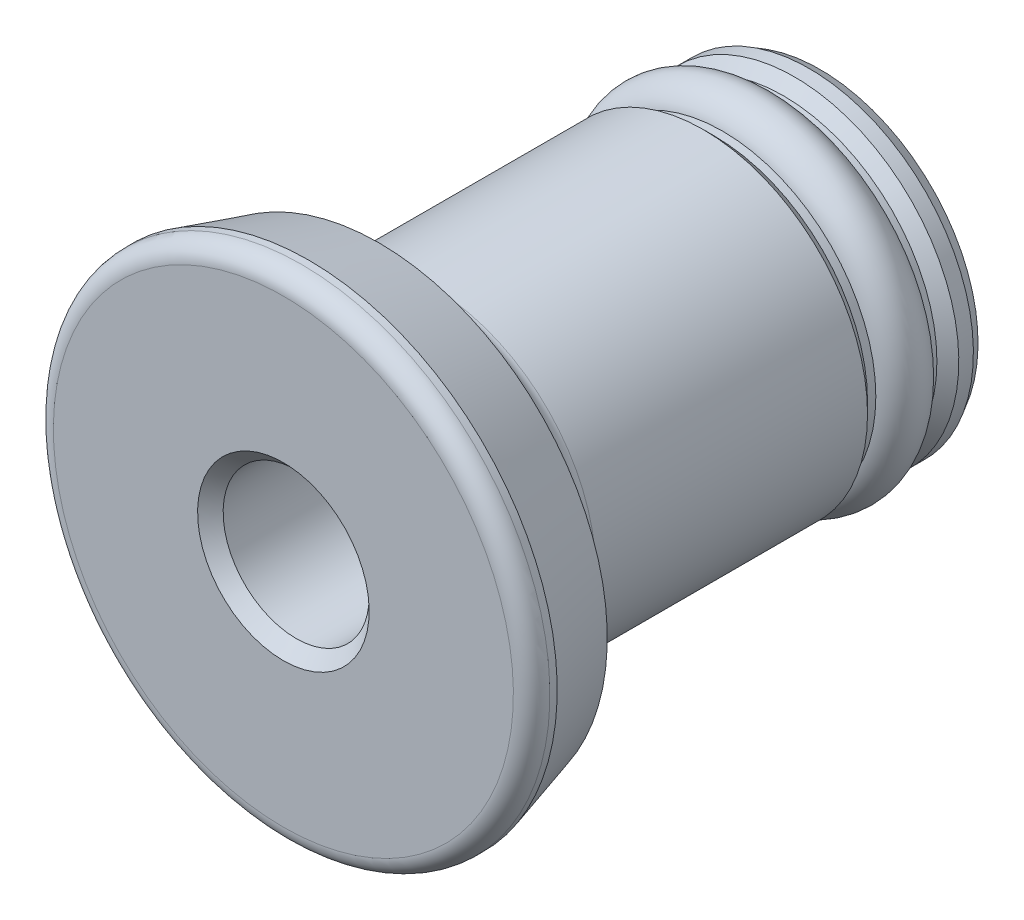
ISO-10303-21;
HEADER;
FILE_DESCRIPTION(('STEP AP214'),'2;1');
FILE_NAME('part.step','',(''),(''),'','','');
FILE_SCHEMA(('AUTOMOTIVE_DESIGN { 1 0 10303 214 1 1 1 1 }'));
ENDSEC;
DATA;
#1=APPLICATION_CONTEXT('core data for automotive mechanical design processes');
#2=APPLICATION_PROTOCOL_DEFINITION('international standard','automotive_design',2000,#1);
#3=PRODUCT_CONTEXT('',#1,'mechanical');
#4=PRODUCT('Part','Part','',(#3));
#5=PRODUCT_RELATED_PRODUCT_CATEGORY('part','',(#4));
#6=PRODUCT_DEFINITION_FORMATION('','',#4);
#7=PRODUCT_DEFINITION_CONTEXT('part definition',#1,'design');
#8=PRODUCT_DEFINITION('design','',#6,#7);
#9=PRODUCT_DEFINITION_SHAPE('','',#8);
#10=(LENGTH_UNIT() NAMED_UNIT(*) SI_UNIT(.MILLI.,.METRE.));
#11=(NAMED_UNIT(*) PLANE_ANGLE_UNIT() SI_UNIT($,.RADIAN.));
#12=(NAMED_UNIT(*) SI_UNIT($,.STERADIAN.) SOLID_ANGLE_UNIT());
#13=UNCERTAINTY_MEASURE_WITH_UNIT(LENGTH_MEASURE(1.E-05),#10,'distance_accuracy_value','');
#14=(GEOMETRIC_REPRESENTATION_CONTEXT(3) GLOBAL_UNCERTAINTY_ASSIGNED_CONTEXT((#13)) GLOBAL_UNIT_ASSIGNED_CONTEXT((#10,
#11,#12)) REPRESENTATION_CONTEXT('',''));
#15=CARTESIAN_POINT('',(0.,0.,0.));
#16=DIRECTION('',(0.,0.,1.));
#17=DIRECTION('',(1.,0.,0.));
#18=AXIS2_PLACEMENT_3D('',#15,#16,#17);
#19=CARTESIAN_POINT('',(0.,0.,-6.));
#20=DIRECTION('',(0.,0.,1.));
#21=DIRECTION('',(0.,-1.,0.));
#22=AXIS2_PLACEMENT_3D('',#19,#20,#21);
#23=PLANE('',#22);
#24=CARTESIAN_POINT('',(0.,0.,-6.));
#25=DIRECTION('',(0.,0.,1.));
#26=DIRECTION('',(0.,-1.,0.));
#27=AXIS2_PLACEMENT_3D('',#24,#25,#26);
#28=CIRCLE('',#27,2.);
#29=CARTESIAN_POINT('',(0.,-2.,-6.));
#30=VERTEX_POINT('',#29);
#31=EDGE_CURVE('E28',#30,#30,#28,.T.);
#32=ORIENTED_EDGE('',*,*,#31,.T.);
#33=EDGE_LOOP('',(#32));
#34=FACE_BOUND('',#33,.T.);
#35=ADVANCED_FACE('F12',(#34),#23,.T.);
#36=CARTESIAN_POINT('',(0.,0.,-6.));
#37=DIRECTION('',(0.,0.,1.));
#38=DIRECTION('',(0.,-1.,0.));
#39=AXIS2_PLACEMENT_3D('',#36,#37,#38);
#40=CYLINDRICAL_SURFACE('',#39,2.);
#41=ORIENTED_EDGE('',*,*,#31,.F.);
#42=EDGE_LOOP('',(#41));
#43=FACE_BOUND('',#42,.T.);
#44=CARTESIAN_POINT('',(0.,0.,-0.35));
#45=DIRECTION('',(0.,0.,1.));
#46=DIRECTION('',(0.,-1.,0.));
#47=AXIS2_PLACEMENT_3D('',#44,#45,#46);
#48=CIRCLE('',#47,2.);
#49=CARTESIAN_POINT('',(0.,-2.,-0.35));
#50=VERTEX_POINT('',#49);
#51=EDGE_CURVE('E16',#50,#50,#48,.F.);
#52=ORIENTED_EDGE('',*,*,#51,.F.);
#53=EDGE_LOOP('',(#52));
#54=FACE_BOUND('',#53,.T.);
#55=ADVANCED_FACE('F84',(#43,#54),#40,.F.);
#56=CARTESIAN_POINT('',(0.,0.,0.));
#57=DIRECTION('',(0.,0.,1.));
#58=DIRECTION('',(0.,-1.,0.));
#59=AXIS2_PLACEMENT_3D('',#56,#57,#58);
#60=CONICAL_SURFACE('',#59,2.35,0.785398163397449);
#61=ORIENTED_EDGE('',*,*,#51,.T.);
#62=EDGE_LOOP('',(#61));
#63=FACE_BOUND('',#62,.T.);
#64=CARTESIAN_POINT('',(0.,0.,0.));
#65=DIRECTION('',(0.,0.,1.));
#66=DIRECTION('',(0.,-1.,0.));
#67=AXIS2_PLACEMENT_3D('',#64,#65,#66);
#68=CIRCLE('',#67,2.35);
#69=CARTESIAN_POINT('',(0.,-2.35,0.));
#70=VERTEX_POINT('',#69);
#71=EDGE_CURVE('E31',#70,#70,#68,.T.);
#72=ORIENTED_EDGE('',*,*,#71,.T.);
#73=EDGE_LOOP('',(#72));
#74=FACE_BOUND('',#73,.T.);
#75=ADVANCED_FACE('F79',(#63,#74),#60,.F.);
#76=CARTESIAN_POINT('',(6.8,0.,0.));
#77=DIRECTION('',(0.,0.,1.));
#78=DIRECTION('',(0.,-1.,0.));
#79=AXIS2_PLACEMENT_3D('',#76,#77,#78);
#80=PLANE('',#79);
#81=CARTESIAN_POINT('',(0.,0.,0.));
#82=DIRECTION('',(0.,0.,1.));
#83=DIRECTION('',(0.,-1.,0.));
#84=AXIS2_PLACEMENT_3D('',#81,#82,#83);
#85=CIRCLE('',#84,6.3);
#86=CARTESIAN_POINT('',(0.,-6.3,0.));
#87=VERTEX_POINT('',#86);
#88=EDGE_CURVE('E64',#87,#87,#85,.T.);
#89=ORIENTED_EDGE('',*,*,#88,.T.);
#90=EDGE_LOOP('',(#89));
#91=FACE_BOUND('',#90,.T.);
#92=ORIENTED_EDGE('',*,*,#71,.F.);
#93=EDGE_LOOP('',(#92));
#94=FACE_BOUND('',#93,.T.);
#95=ADVANCED_FACE('F74',(#91,#94),#80,.T.);
#96=CARTESIAN_POINT('',(0.,0.,-0.5));
#97=DIRECTION('',(0.,0.,1.));
#98=DIRECTION('',(0.,-1.,0.));
#99=AXIS2_PLACEMENT_3D('',#96,#97,#98);
#100=TOROIDAL_SURFACE('',#99,6.3,0.5);
#101=CARTESIAN_POINT('',(0.,0.,-0.5));
#102=DIRECTION('',(0.,0.,1.));
#103=DIRECTION('',(0.,-1.,0.));
#104=AXIS2_PLACEMENT_3D('',#101,#102,#103);
#105=CIRCLE('',#104,6.8);
#106=CARTESIAN_POINT('',(0.,-6.8,-0.5));
#107=VERTEX_POINT('',#106);
#108=EDGE_CURVE('E25',#107,#107,#105,.F.);
#109=ORIENTED_EDGE('',*,*,#108,.F.);
#110=EDGE_LOOP('',(#109));
#111=FACE_BOUND('',#110,.T.);
#112=ORIENTED_EDGE('',*,*,#88,.F.);
#113=EDGE_LOOP('',(#112));
#114=FACE_BOUND('',#113,.T.);
#115=ADVANCED_FACE('F14',(#111,#114),#100,.T.);
#116=CARTESIAN_POINT('',(0.,0.,0.5));
#117=DIRECTION('',(0.,0.,1.));
#118=DIRECTION('',(0.,-1.,0.));
#119=AXIS2_PLACEMENT_3D('',#116,#117,#118);
#120=CYLINDRICAL_SURFACE('',#119,6.8);
#121=ORIENTED_EDGE('',*,*,#108,.T.);
#122=EDGE_LOOP('',(#121));
#123=FACE_BOUND('',#122,.T.);
#124=CARTESIAN_POINT('',(0.,0.,-0.7));
#125=DIRECTION('',(0.,0.,1.));
#126=DIRECTION('',(0.,-1.,0.));
#127=AXIS2_PLACEMENT_3D('',#124,#125,#126);
#128=CIRCLE('',#127,6.8);
#129=CARTESIAN_POINT('',(0.,-6.8,-0.7));
#130=VERTEX_POINT('',#129);
#131=EDGE_CURVE('E37',#130,#130,#128,.T.);
#132=ORIENTED_EDGE('',*,*,#131,.T.);
#133=EDGE_LOOP('',(#132));
#134=FACE_BOUND('',#133,.T.);
#135=ADVANCED_FACE('F69',(#123,#134),#120,.T.);
#136=CARTESIAN_POINT('',(0.,0.,-2.62252339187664));
#137=DIRECTION('',(0.,0.,1.));
#138=DIRECTION('',(0.,-1.,0.));
#139=AXIS2_PLACEMENT_3D('',#136,#137,#138);
#140=CONICAL_SURFACE('',#139,6.24872528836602,0.279252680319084);
#141=ORIENTED_EDGE('',*,*,#131,.F.);
#142=EDGE_LOOP('',(#141));
#143=FACE_BOUND('',#142,.T.);
#144=CARTESIAN_POINT('',(0.,0.,-2.62252339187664));
#145=DIRECTION('',(0.,0.,1.));
#146=DIRECTION('',(0.,-1.,0.));
#147=AXIS2_PLACEMENT_3D('',#144,#145,#146);
#148=CIRCLE('',#147,6.24872528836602);
#149=CARTESIAN_POINT('',(0.,-6.24872528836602,-2.62252339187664));
#150=VERTEX_POINT('',#149);
#151=EDGE_CURVE('E34',#150,#150,#148,.T.);
#152=ORIENTED_EDGE('',*,*,#151,.T.);
#153=EDGE_LOOP('',(#152));
#154=FACE_BOUND('',#153,.T.);
#155=ADVANCED_FACE('F144',(#143,#154),#140,.T.);
#156=CARTESIAN_POINT('',(0.,0.,-3.8469940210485));
#157=DIRECTION('',(0.,0.,1.));
#158=DIRECTION('',(0.,-1.,0.));
#159=AXIS2_PLACEMENT_3D('',#156,#157,#158);
#160=CONICAL_SURFACE('',#159,4.5,0.959931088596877);
#161=CARTESIAN_POINT('',(0.,0.,-3.7275600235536));
#162=DIRECTION('',(0.,0.,1.));
#163=DIRECTION('',(0.,-1.,0.));
#164=AXIS2_PLACEMENT_3D('',#161,#162,#163);
#165=CIRCLE('',#164,4.67056942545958);
#166=CARTESIAN_POINT('',(0.,-4.67056942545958,-3.7275600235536));
#167=VERTEX_POINT('',#166);
#168=EDGE_CURVE('E40',#167,#167,#165,.T.);
#169=ORIENTED_EDGE('',*,*,#168,.T.);
#170=EDGE_LOOP('',(#169));
#171=FACE_BOUND('',#170,.T.);
#172=ORIENTED_EDGE('',*,*,#151,.F.);
#173=EDGE_LOOP('',(#172));
#174=FACE_BOUND('',#173,.T.);
#175=ADVANCED_FACE('F138',(#171,#174),#160,.T.);
#176=CARTESIAN_POINT('',(0.,0.,-4.0552208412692));
#177=DIRECTION('',(0.,0.,1.));
#178=DIRECTION('',(0.,-1.,0.));
#179=AXIS2_PLACEMENT_3D('',#176,#177,#178);
#180=TOROIDAL_SURFACE('',#179,4.9,0.4);
#181=CARTESIAN_POINT('',(0.,0.,-4.0552208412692));
#182=DIRECTION('',(0.,0.,1.));
#183=DIRECTION('',(0.,-1.,0.));
#184=AXIS2_PLACEMENT_3D('',#181,#182,#183);
#185=CIRCLE('',#184,4.5);
#186=CARTESIAN_POINT('',(0.,-4.5,-4.0552208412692));
#187=VERTEX_POINT('',#186);
#188=EDGE_CURVE('E43',#187,#187,#185,.F.);
#189=ORIENTED_EDGE('',*,*,#188,.F.);
#190=EDGE_LOOP('',(#189));
#191=FACE_BOUND('',#190,.T.);
#192=ORIENTED_EDGE('',*,*,#168,.F.);
#193=EDGE_LOOP('',(#192));
#194=FACE_BOUND('',#193,.T.);
#195=ADVANCED_FACE('F132',(#191,#194),#180,.F.);
#196=CARTESIAN_POINT('',(0.,0.,0.5));
#197=DIRECTION('',(0.,0.,1.));
#198=DIRECTION('',(0.,-1.,0.));
#199=AXIS2_PLACEMENT_3D('',#196,#197,#198);
#200=CYLINDRICAL_SURFACE('',#199,4.5);
#201=CARTESIAN_POINT('',(0.,0.,-11.5));
#202=DIRECTION('',(0.,0.,-1.));
#203=DIRECTION('',(0.,1.,0.));
#204=AXIS2_PLACEMENT_3D('',#201,#202,#203);
#205=CIRCLE('',#204,4.5);
#206=CARTESIAN_POINT('',(0.,4.5,-11.5));
#207=VERTEX_POINT('',#206);
#208=EDGE_CURVE('E52',#207,#207,#205,.F.);
#209=ORIENTED_EDGE('',*,*,#208,.T.);
#210=EDGE_LOOP('',(#209));
#211=FACE_BOUND('',#210,.T.);
#212=ORIENTED_EDGE('',*,*,#188,.T.);
#213=EDGE_LOOP('',(#212));
#214=FACE_BOUND('',#213,.T.);
#215=ADVANCED_FACE('F121',(#211,#214),#200,.T.);
#216=CARTESIAN_POINT('',(0.,0.,-11.5));
#217=DIRECTION('',(0.,0.,1.));
#218=DIRECTION('',(0.,-1.,0.));
#219=AXIS2_PLACEMENT_3D('',#216,#217,#218);
#220=CONICAL_SURFACE('',#219,4.5,0.785398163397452);
#221=CARTESIAN_POINT('',(0.,0.,-11.8));
#222=DIRECTION('',(0.,0.,-1.));
#223=DIRECTION('',(0.,1.,0.));
#224=AXIS2_PLACEMENT_3D('',#221,#222,#223);
#225=CIRCLE('',#224,4.2);
#226=CARTESIAN_POINT('',(0.,4.2,-11.8));
#227=VERTEX_POINT('',#226);
#228=EDGE_CURVE('E55',#227,#227,#225,.T.);
#229=ORIENTED_EDGE('',*,*,#228,.F.);
#230=EDGE_LOOP('',(#229));
#231=FACE_BOUND('',#230,.T.);
#232=ORIENTED_EDGE('',*,*,#208,.F.);
#233=EDGE_LOOP('',(#232));
#234=FACE_BOUND('',#233,.T.);
#235=ADVANCED_FACE('F113',(#231,#234),#220,.T.);
#236=CARTESIAN_POINT('',(0.,0.,1.9796198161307));
#237=DIRECTION('',(0.,0.,1.));
#238=DIRECTION('',(0.,-1.,0.));
#239=AXIS2_PLACEMENT_3D('',#236,#237,#238);
#240=CYLINDRICAL_SURFACE('',#239,4.2);
#241=CARTESIAN_POINT('',(0.,0.,-12.0271583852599));
#242=DIRECTION('',(0.,0.,-1.));
#243=DIRECTION('',(0.,1.,0.));
#244=AXIS2_PLACEMENT_3D('',#241,#242,#243);
#245=CIRCLE('',#244,4.2);
#246=CARTESIAN_POINT('',(0.,4.2,-12.0271583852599));
#247=VERTEX_POINT('',#246);
#248=EDGE_CURVE('E20',#247,#247,#245,.T.);
#249=ORIENTED_EDGE('',*,*,#248,.F.);
#250=EDGE_LOOP('',(#249));
#251=FACE_BOUND('',#250,.T.);
#252=ORIENTED_EDGE('',*,*,#228,.T.);
#253=EDGE_LOOP('',(#252));
#254=FACE_BOUND('',#253,.T.);
#255=ADVANCED_FACE('F110',(#251,#254),#240,.T.);
#256=CARTESIAN_POINT('',(0.,0.,-13.47284161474));
#257=DIRECTION('',(0.,0.,1.));
#258=DIRECTION('',(0.,-1.,0.));
#259=AXIS2_PLACEMENT_3D('',#256,#257,#258);
#260=CIRCLE('',#259,4.2);
#261=CARTESIAN_POINT('',(0.,-4.2,-13.47284161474));
#262=VERTEX_POINT('',#261);
#263=EDGE_CURVE('E8',#262,#262,#260,.T.);
#264=ORIENTED_EDGE('',*,*,#263,.F.);
#265=EDGE_LOOP('',(#264));
#266=FACE_BOUND('',#265,.T.);
#267=CARTESIAN_POINT('',(0.,0.,-13.7));
#268=DIRECTION('',(0.,0.,1.));
#269=DIRECTION('',(0.,-1.,0.));
#270=AXIS2_PLACEMENT_3D('',#267,#268,#269);
#271=CIRCLE('',#270,4.2);
#272=CARTESIAN_POINT('',(0.,-4.2,-13.7));
#273=VERTEX_POINT('',#272);
#274=EDGE_CURVE('E58',#273,#273,#271,.T.);
#275=ORIENTED_EDGE('',*,*,#274,.T.);
#276=EDGE_LOOP('',(#275));
#277=FACE_BOUND('',#276,.T.);
#278=ADVANCED_FACE('F112',(#266,#277),#240,.T.);
#279=CARTESIAN_POINT('',(4.5,0.,-14.7));
#280=DIRECTION('',(0.,0.,1.));
#281=DIRECTION('',(0.,-1.,0.));
#282=AXIS2_PLACEMENT_3D('',#279,#280,#281);
#283=PLANE('',#282);
#284=CARTESIAN_POINT('',(0.,0.,-14.7));
#285=DIRECTION('',(0.,0.,1.));
#286=DIRECTION('',(0.,-1.,0.));
#287=AXIS2_PLACEMENT_3D('',#284,#285,#286);
#288=CIRCLE('',#287,4.32679491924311);
#289=CARTESIAN_POINT('',(0.,-4.32679491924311,-14.7));
#290=VERTEX_POINT('',#289);
#291=EDGE_CURVE('E49',#290,#290,#288,.F.);
#292=ORIENTED_EDGE('',*,*,#291,.T.);
#293=EDGE_LOOP('',(#292));
#294=FACE_BOUND('',#293,.T.);
#295=ADVANCED_FACE('F119',(#294),#283,.F.);
#296=CARTESIAN_POINT('',(0.,0.,-14.4));
#297=DIRECTION('',(0.,0.,1.));
#298=DIRECTION('',(0.,-1.,0.));
#299=AXIS2_PLACEMENT_3D('',#296,#297,#298);
#300=CONICAL_SURFACE('',#299,4.5,0.523598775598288);
#301=ORIENTED_EDGE('',*,*,#291,.F.);
#302=EDGE_LOOP('',(#301));
#303=FACE_BOUND('',#302,.T.);
#304=CARTESIAN_POINT('',(0.,0.,-14.4));
#305=DIRECTION('',(0.,0.,1.));
#306=DIRECTION('',(0.,-1.,0.));
#307=AXIS2_PLACEMENT_3D('',#304,#305,#306);
#308=CIRCLE('',#307,4.5);
#309=CARTESIAN_POINT('',(0.,-4.5,-14.4));
#310=VERTEX_POINT('',#309);
#311=EDGE_CURVE('E46',#310,#310,#308,.T.);
#312=ORIENTED_EDGE('',*,*,#311,.F.);
#313=EDGE_LOOP('',(#312));
#314=FACE_BOUND('',#313,.T.);
#315=ADVANCED_FACE('F157',(#303,#314),#300,.T.);
#316=CARTESIAN_POINT('',(0.,0.,-14.));
#317=DIRECTION('',(0.,0.,1.));
#318=DIRECTION('',(0.,-1.,0.));
#319=AXIS2_PLACEMENT_3D('',#316,#317,#318);
#320=CIRCLE('',#319,4.5);
#321=CARTESIAN_POINT('',(0.,-4.5,-14.));
#322=VERTEX_POINT('',#321);
#323=EDGE_CURVE('E61',#322,#322,#320,.F.);
#324=ORIENTED_EDGE('',*,*,#323,.T.);
#325=EDGE_LOOP('',(#324));
#326=FACE_BOUND('',#325,.T.);
#327=ORIENTED_EDGE('',*,*,#311,.T.);
#328=EDGE_LOOP('',(#327));
#329=FACE_BOUND('',#328,.T.);
#330=ADVANCED_FACE('F102',(#326,#329),#200,.T.);
#331=CARTESIAN_POINT('',(0.,0.,-13.7));
#332=DIRECTION('',(0.,0.,-1.));
#333=DIRECTION('',(0.,1.,0.));
#334=AXIS2_PLACEMENT_3D('',#331,#332,#333);
#335=CONICAL_SURFACE('',#334,4.2,0.78539816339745);
#336=ORIENTED_EDGE('',*,*,#323,.F.);
#337=EDGE_LOOP('',(#336));
#338=FACE_BOUND('',#337,.T.);
#339=ORIENTED_EDGE('',*,*,#274,.F.);
#340=EDGE_LOOP('',(#339));
#341=FACE_BOUND('',#340,.T.);
#342=ADVANCED_FACE('F96',(#338,#341),#335,.T.);
#343=CARTESIAN_POINT('',(0.,0.,-12.75));
#344=DIRECTION('',(0.,0.,-1.));
#345=DIRECTION('',(0.,1.,0.));
#346=AXIS2_PLACEMENT_3D('',#343,#344,#345);
#347=TOROIDAL_SURFACE('',#346,4.,0.75);
#348=ORIENTED_EDGE('',*,*,#248,.T.);
#349=EDGE_LOOP('',(#348));
#350=FACE_BOUND('',#349,.T.);
#351=ORIENTED_EDGE('',*,*,#263,.T.);
#352=EDGE_LOOP('',(#351));
#353=FACE_BOUND('',#352,.T.);
#354=ADVANCED_FACE('F94',(#350,#353),#347,.T.);
#355=CLOSED_SHELL('',(#35,#55,#75,#95,#115,#135,#155,#175,#195,#215,#235,#255,#278,#295,#315,
#330,#342,#354));
#356=MANIFOLD_SOLID_BREP('B1',#355);
#357=ADVANCED_BREP_SHAPE_REPRESENTATION('',(#18,#356),#14);
#358=SHAPE_DEFINITION_REPRESENTATION(#9,#357);
ENDSEC;
END-ISO-10303-21;
